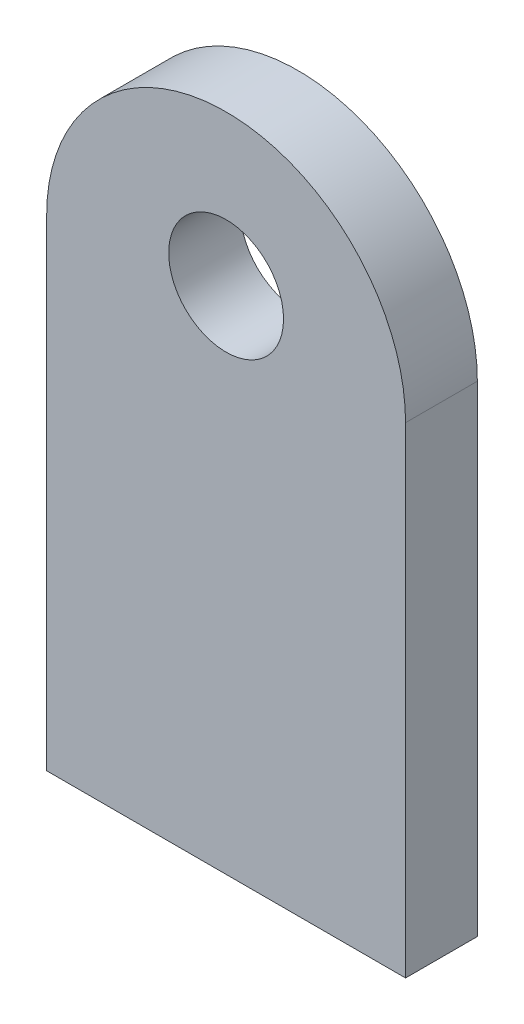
ISO-10303-21;
HEADER;
FILE_DESCRIPTION(('STEP AP214'),'2;1');
FILE_NAME('part.step','',(''),(''),'','','');
FILE_SCHEMA(('AUTOMOTIVE_DESIGN { 1 0 10303 214 1 1 1 1 }'));
ENDSEC;
DATA;
#1=APPLICATION_CONTEXT('core data for automotive mechanical design processes');
#2=APPLICATION_PROTOCOL_DEFINITION('international standard','automotive_design',2000,#1);
#3=PRODUCT_CONTEXT('',#1,'mechanical');
#4=PRODUCT('Part','Part','',(#3));
#5=PRODUCT_RELATED_PRODUCT_CATEGORY('part','',(#4));
#6=PRODUCT_DEFINITION_FORMATION('','',#4);
#7=PRODUCT_DEFINITION_CONTEXT('part definition',#1,'design');
#8=PRODUCT_DEFINITION('design','',#6,#7);
#9=PRODUCT_DEFINITION_SHAPE('','',#8);
#10=(LENGTH_UNIT() NAMED_UNIT(*) SI_UNIT(.MILLI.,.METRE.));
#11=(NAMED_UNIT(*) PLANE_ANGLE_UNIT() SI_UNIT($,.RADIAN.));
#12=(NAMED_UNIT(*) SI_UNIT($,.STERADIAN.) SOLID_ANGLE_UNIT());
#13=UNCERTAINTY_MEASURE_WITH_UNIT(LENGTH_MEASURE(1.E-05),#10,'distance_accuracy_value','');
#14=(GEOMETRIC_REPRESENTATION_CONTEXT(3) GLOBAL_UNCERTAINTY_ASSIGNED_CONTEXT((#13)) GLOBAL_UNIT_ASSIGNED_CONTEXT((#10,
#11,#12)) REPRESENTATION_CONTEXT('',''));
#15=CARTESIAN_POINT('',(0.,0.,0.));
#16=DIRECTION('',(0.,0.,1.));
#17=DIRECTION('',(1.,0.,0.));
#18=AXIS2_PLACEMENT_3D('',#15,#16,#17);
#19=CARTESIAN_POINT('',(-12.5,33.5,5.));
#20=DIRECTION('',(1.,0.,0.));
#21=DIRECTION('',(0.,1.,0.));
#22=AXIS2_PLACEMENT_3D('',#19,#20,#21);
#23=PLANE('',#22);
#24=DIRECTION('',(0.,-1.,0.));
#25=VECTOR('',#24,1.);
#26=CARTESIAN_POINT('',(-12.5,33.5,0.));
#27=LINE('',#26,#25);
#28=CARTESIAN_POINT('',(-12.5,33.5,0.));
#29=VERTEX_POINT('',#28);
#30=CARTESIAN_POINT('',(-12.5,0.,0.));
#31=VERTEX_POINT('',#30);
#32=EDGE_CURVE('E98',#29,#31,#27,.T.);
#33=ORIENTED_EDGE('',*,*,#32,.T.);
#34=DIRECTION('',(0.,0.,-1.));
#35=VECTOR('',#34,1.);
#36=CARTESIAN_POINT('',(-12.5,0.,5.));
#37=LINE('',#36,#35);
#38=CARTESIAN_POINT('',(-12.5,0.,5.));
#39=VERTEX_POINT('',#38);
#40=EDGE_CURVE('E11',#39,#31,#37,.T.);
#41=ORIENTED_EDGE('',*,*,#40,.F.);
#42=DIRECTION('',(0.,-1.,0.));
#43=VECTOR('',#42,1.);
#44=CARTESIAN_POINT('',(-12.5,33.5,5.));
#45=LINE('',#44,#43);
#46=CARTESIAN_POINT('',(-12.5,33.5,5.));
#47=VERTEX_POINT('',#46);
#48=EDGE_CURVE('E86',#47,#39,#45,.T.);
#49=ORIENTED_EDGE('',*,*,#48,.F.);
#50=DIRECTION('',(0.,0.,-1.));
#51=VECTOR('',#50,1.);
#52=CARTESIAN_POINT('',(-12.5,33.5,5.));
#53=LINE('',#52,#51);
#54=EDGE_CURVE('E94',#47,#29,#53,.T.);
#55=ORIENTED_EDGE('',*,*,#54,.T.);
#56=EDGE_LOOP('',(#33,#41,#49,#55));
#57=FACE_BOUND('',#56,.T.);
#58=ADVANCED_FACE('F35',(#57),#23,.F.);
#59=CARTESIAN_POINT('',(-12.5,0.,5.));
#60=DIRECTION('',(0.,1.,0.));
#61=DIRECTION('',(-1.,0.,0.));
#62=AXIS2_PLACEMENT_3D('',#59,#60,#61);
#63=PLANE('',#62);
#64=DIRECTION('',(1.,0.,0.));
#65=VECTOR('',#64,1.);
#66=CARTESIAN_POINT('',(-12.5,0.,0.));
#67=LINE('',#66,#65);
#68=CARTESIAN_POINT('',(12.5,0.,0.));
#69=VERTEX_POINT('',#68);
#70=EDGE_CURVE('E90',#31,#69,#67,.T.);
#71=ORIENTED_EDGE('',*,*,#70,.T.);
#72=DIRECTION('',(0.,0.,-1.));
#73=VECTOR('',#72,1.);
#74=CARTESIAN_POINT('',(12.5,0.,5.));
#75=LINE('',#74,#73);
#76=CARTESIAN_POINT('',(12.5,0.,5.));
#77=VERTEX_POINT('',#76);
#78=EDGE_CURVE('E43',#77,#69,#75,.T.);
#79=ORIENTED_EDGE('',*,*,#78,.F.);
#80=DIRECTION('',(1.,0.,0.));
#81=VECTOR('',#80,1.);
#82=CARTESIAN_POINT('',(-12.5,0.,5.));
#83=LINE('',#82,#81);
#84=EDGE_CURVE('E81',#39,#77,#83,.T.);
#85=ORIENTED_EDGE('',*,*,#84,.F.);
#86=ORIENTED_EDGE('',*,*,#40,.T.);
#87=EDGE_LOOP('',(#71,#79,#85,#86));
#88=FACE_BOUND('',#87,.T.);
#89=ADVANCED_FACE('F89',(#88),#63,.F.);
#90=CARTESIAN_POINT('',(12.5,0.,5.));
#91=DIRECTION('',(-1.,0.,0.));
#92=DIRECTION('',(0.,-1.,0.));
#93=AXIS2_PLACEMENT_3D('',#90,#91,#92);
#94=PLANE('',#93);
#95=DIRECTION('',(0.,1.,0.));
#96=VECTOR('',#95,1.);
#97=CARTESIAN_POINT('',(12.5,0.,0.));
#98=LINE('',#97,#96);
#99=CARTESIAN_POINT('',(12.5,33.5,0.));
#100=VERTEX_POINT('',#99);
#101=EDGE_CURVE('E68',#69,#100,#98,.T.);
#102=ORIENTED_EDGE('',*,*,#101,.T.);
#103=DIRECTION('',(0.,0.,-1.));
#104=VECTOR('',#103,1.);
#105=CARTESIAN_POINT('',(12.5,33.5,5.));
#106=LINE('',#105,#104);
#107=CARTESIAN_POINT('',(12.5,33.5,5.));
#108=VERTEX_POINT('',#107);
#109=EDGE_CURVE('E91',#108,#100,#106,.T.);
#110=ORIENTED_EDGE('',*,*,#109,.F.);
#111=DIRECTION('',(0.,1.,0.));
#112=VECTOR('',#111,1.);
#113=CARTESIAN_POINT('',(12.5,0.,5.));
#114=LINE('',#113,#112);
#115=EDGE_CURVE('E84',#77,#108,#114,.T.);
#116=ORIENTED_EDGE('',*,*,#115,.F.);
#117=ORIENTED_EDGE('',*,*,#78,.T.);
#118=EDGE_LOOP('',(#102,#110,#116,#117));
#119=FACE_BOUND('',#118,.T.);
#120=ADVANCED_FACE('F92',(#119),#94,.F.);
#121=CARTESIAN_POINT('',(0.,33.5,5.));
#122=DIRECTION('',(0.,0.,-1.));
#123=DIRECTION('',(-1.,0.,0.));
#124=AXIS2_PLACEMENT_3D('',#121,#122,#123);
#125=CYLINDRICAL_SURFACE('',#124,12.5);
#126=CARTESIAN_POINT('',(0.,33.5,0.));
#127=DIRECTION('',(0.,0.,1.));
#128=DIRECTION('',(1.,0.,0.));
#129=AXIS2_PLACEMENT_3D('',#126,#127,#128);
#130=CIRCLE('',#129,12.5);
#131=EDGE_CURVE('E74',#100,#29,#130,.T.);
#132=ORIENTED_EDGE('',*,*,#131,.T.);
#133=ORIENTED_EDGE('',*,*,#54,.F.);
#134=CARTESIAN_POINT('',(0.,33.5,5.));
#135=DIRECTION('',(0.,0.,1.));
#136=DIRECTION('',(1.,0.,0.));
#137=AXIS2_PLACEMENT_3D('',#134,#135,#136);
#138=CIRCLE('',#137,12.5);
#139=EDGE_CURVE('E51',#108,#47,#138,.T.);
#140=ORIENTED_EDGE('',*,*,#139,.F.);
#141=ORIENTED_EDGE('',*,*,#109,.T.);
#142=EDGE_LOOP('',(#132,#133,#140,#141));
#143=FACE_BOUND('',#142,.T.);
#144=ADVANCED_FACE('F106',(#143),#125,.T.);
#145=CARTESIAN_POINT('',(0.,33.5,5.));
#146=DIRECTION('',(0.,0.,1.));
#147=DIRECTION('',(1.,0.,0.));
#148=AXIS2_PLACEMENT_3D('',#145,#146,#147);
#149=PLANE('',#148);
#150=CARTESIAN_POINT('',(0.,35.5,5.));
#151=DIRECTION('',(0.,0.,1.));
#152=DIRECTION('',(1.,0.,0.));
#153=AXIS2_PLACEMENT_3D('',#150,#151,#152);
#154=CIRCLE('',#153,3.99999999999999);
#155=CARTESIAN_POINT('',(3.99999999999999,35.5,5.));
#156=VERTEX_POINT('',#155);
#157=EDGE_CURVE('E114',#156,#156,#154,.T.);
#158=ORIENTED_EDGE('',*,*,#157,.F.);
#159=EDGE_LOOP('',(#158));
#160=FACE_BOUND('',#159,.T.);
#161=ORIENTED_EDGE('',*,*,#48,.T.);
#162=ORIENTED_EDGE('',*,*,#84,.T.);
#163=ORIENTED_EDGE('',*,*,#115,.T.);
#164=ORIENTED_EDGE('',*,*,#139,.T.);
#165=EDGE_LOOP('',(#161,#162,#163,#164));
#166=FACE_BOUND('',#165,.T.);
#167=ADVANCED_FACE('F82',(#160,#166),#149,.T.);
#168=CARTESIAN_POINT('',(0.,33.5,0.));
#169=DIRECTION('',(0.,0.,1.));
#170=DIRECTION('',(1.,0.,0.));
#171=AXIS2_PLACEMENT_3D('',#168,#169,#170);
#172=PLANE('',#171);
#173=CARTESIAN_POINT('',(0.,35.5,0.));
#174=DIRECTION('',(0.,0.,1.));
#175=DIRECTION('',(1.,0.,0.));
#176=AXIS2_PLACEMENT_3D('',#173,#174,#175);
#177=CIRCLE('',#176,4.);
#178=CARTESIAN_POINT('',(4.,35.5,0.));
#179=VERTEX_POINT('',#178);
#180=EDGE_CURVE('E101',#179,#179,#177,.T.);
#181=ORIENTED_EDGE('',*,*,#180,.T.);
#182=EDGE_LOOP('',(#181));
#183=FACE_BOUND('',#182,.T.);
#184=ORIENTED_EDGE('',*,*,#32,.F.);
#185=ORIENTED_EDGE('',*,*,#131,.F.);
#186=ORIENTED_EDGE('',*,*,#101,.F.);
#187=ORIENTED_EDGE('',*,*,#70,.F.);
#188=EDGE_LOOP('',(#184,#185,#186,#187));
#189=FACE_BOUND('',#188,.T.);
#190=ADVANCED_FACE('F109',(#183,#189),#172,.F.);
#191=CARTESIAN_POINT('',(0.,35.5,5.));
#192=DIRECTION('',(0.,0.,1.));
#193=DIRECTION('',(1.,0.,0.));
#194=AXIS2_PLACEMENT_3D('',#191,#192,#193);
#195=CYLINDRICAL_SURFACE('',#194,3.99999999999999);
#196=ORIENTED_EDGE('',*,*,#180,.F.);
#197=EDGE_LOOP('',(#196));
#198=FACE_BOUND('',#197,.T.);
#199=ORIENTED_EDGE('',*,*,#157,.T.);
#200=EDGE_LOOP('',(#199));
#201=FACE_BOUND('',#200,.T.);
#202=ADVANCED_FACE('F118',(#198,#201),#195,.F.);
#203=CLOSED_SHELL('',(#58,#89,#120,#144,#167,#190,#202));
#204=MANIFOLD_SOLID_BREP('B2',#203);
#205=ADVANCED_BREP_SHAPE_REPRESENTATION('',(#18,#204),#14);
#206=SHAPE_DEFINITION_REPRESENTATION(#9,#205);
ENDSEC;
END-ISO-10303-21;
